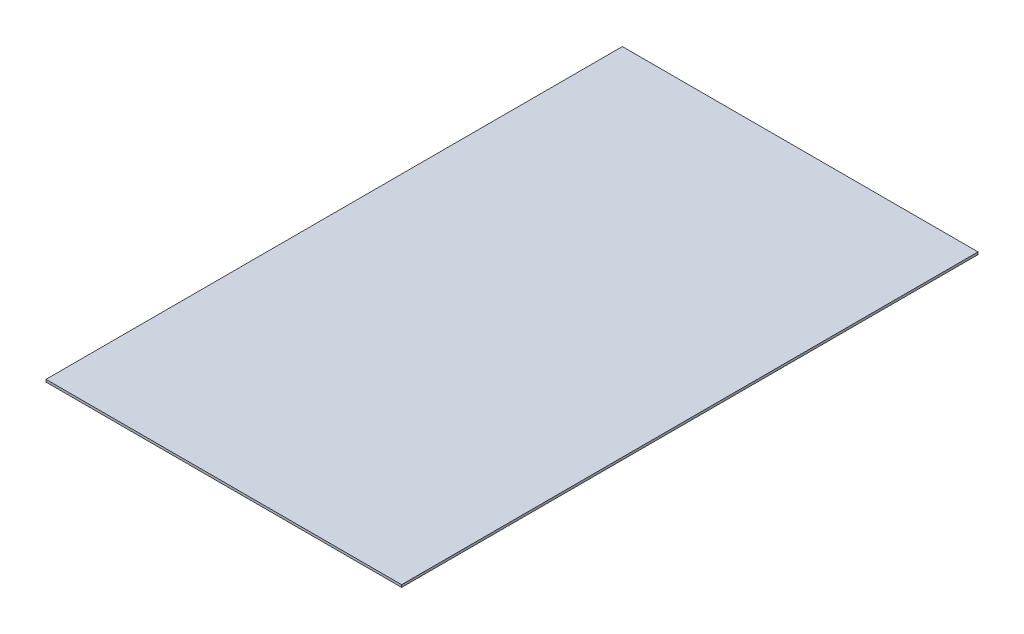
from build123d import *

# Parameters (mm, degrees)
SKETCH1_W           = 1473.2
SKETCH1_H           = 2387.6
BOSS_EXTRUDE1_DEPTH = 10


with BuildPart() as part:
    # Sketch1 → Boss-Extrude1 (new body)
    with BuildSketch(Plane(origin=(0, 0, 0), x_dir=(1, 0, 0), z_dir=(0, 1, 0))):
        with Locations((736.6, 1193.8)):
            Rectangle(SKETCH1_W, SKETCH1_H)
    extrude(amount=BOSS_EXTRUDE1_DEPTH)


solid = part.part
